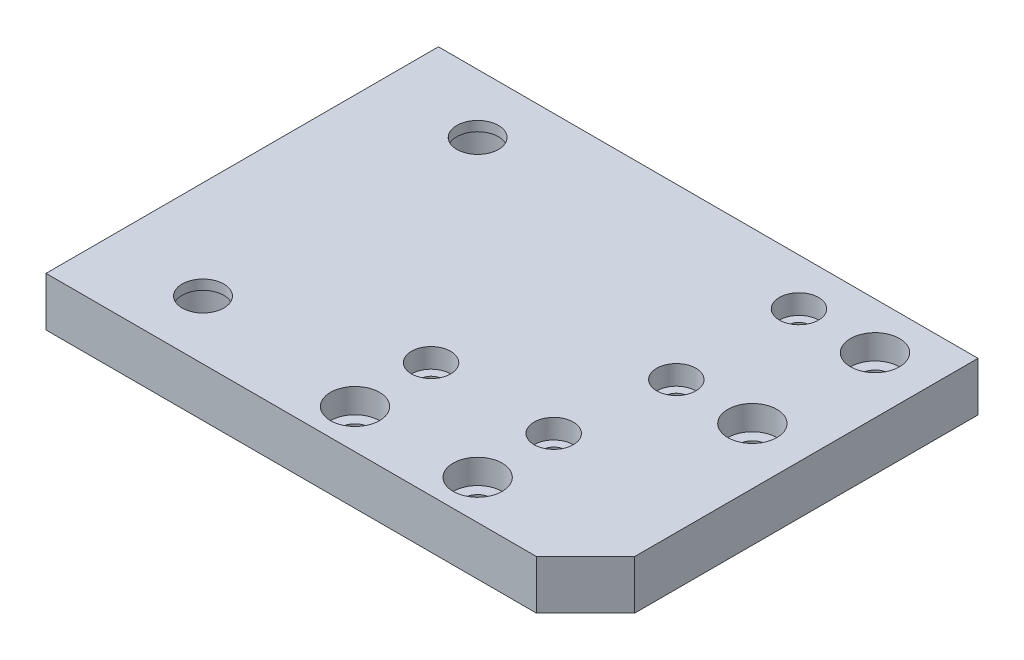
ISO-10303-21;
HEADER;
FILE_DESCRIPTION(('STEP AP214'),'2;1');
FILE_NAME('part.step','',(''),(''),'','','');
FILE_SCHEMA(('AUTOMOTIVE_DESIGN { 1 0 10303 214 1 1 1 1 }'));
ENDSEC;
DATA;
#1=APPLICATION_CONTEXT('core data for automotive mechanical design processes');
#2=APPLICATION_PROTOCOL_DEFINITION('international standard','automotive_design',2000,#1);
#3=PRODUCT_CONTEXT('',#1,'mechanical');
#4=PRODUCT('Part','Part','',(#3));
#5=PRODUCT_RELATED_PRODUCT_CATEGORY('part','',(#4));
#6=PRODUCT_DEFINITION_FORMATION('','',#4);
#7=PRODUCT_DEFINITION_CONTEXT('part definition',#1,'design');
#8=PRODUCT_DEFINITION('design','',#6,#7);
#9=PRODUCT_DEFINITION_SHAPE('','',#8);
#10=(LENGTH_UNIT() NAMED_UNIT(*) SI_UNIT(.MILLI.,.METRE.));
#11=(NAMED_UNIT(*) PLANE_ANGLE_UNIT() SI_UNIT($,.RADIAN.));
#12=(NAMED_UNIT(*) SI_UNIT($,.STERADIAN.) SOLID_ANGLE_UNIT());
#13=UNCERTAINTY_MEASURE_WITH_UNIT(LENGTH_MEASURE(1.E-05),#10,'distance_accuracy_value','');
#14=(GEOMETRIC_REPRESENTATION_CONTEXT(3) GLOBAL_UNCERTAINTY_ASSIGNED_CONTEXT((#13)) GLOBAL_UNIT_ASSIGNED_CONTEXT((#10,
#11,#12)) REPRESENTATION_CONTEXT('',''));
#15=CARTESIAN_POINT('',(0.,0.,0.));
#16=DIRECTION('',(0.,0.,1.));
#17=DIRECTION('',(1.,0.,0.));
#18=AXIS2_PLACEMENT_3D('',#15,#16,#17);
#19=CARTESIAN_POINT('',(-35.,0.,28.));
#20=DIRECTION('',(0.,1.,0.));
#21=DIRECTION('',(0.,0.,1.));
#22=AXIS2_PLACEMENT_3D('',#19,#20,#21);
#23=CYLINDRICAL_SURFACE('',#22,4.25);
#24=CARTESIAN_POINT('',(-35.,10.,28.));
#25=DIRECTION('',(0.,1.,0.));
#26=DIRECTION('',(0.,0.,1.));
#27=AXIS2_PLACEMENT_3D('',#24,#25,#26);
#28=CIRCLE('',#27,4.25);
#29=CARTESIAN_POINT('',(-35.,10.,32.25));
#30=VERTEX_POINT('',#29);
#31=EDGE_CURVE('E174',#30,#30,#28,.F.);
#32=ORIENTED_EDGE('',*,*,#31,.F.);
#33=EDGE_LOOP('',(#32));
#34=FACE_BOUND('',#33,.T.);
#35=CARTESIAN_POINT('',(-35.,8.,28.));
#36=DIRECTION('',(0.,1.,0.));
#37=DIRECTION('',(0.,0.,1.));
#38=AXIS2_PLACEMENT_3D('',#35,#36,#37);
#39=CIRCLE('',#38,4.25);
#40=CARTESIAN_POINT('',(-35.,8.,32.25));
#41=VERTEX_POINT('',#40);
#42=EDGE_CURVE('E200',#41,#41,#39,.T.);
#43=ORIENTED_EDGE('',*,*,#42,.F.);
#44=EDGE_LOOP('',(#43));
#45=FACE_BOUND('',#44,.T.);
#46=ADVANCED_FACE('F17',(#34,#45),#23,.F.);
#47=CARTESIAN_POINT('',(-35.,0.,-28.));
#48=DIRECTION('',(0.,1.,0.));
#49=DIRECTION('',(0.,0.,1.));
#50=AXIS2_PLACEMENT_3D('',#47,#48,#49);
#51=CYLINDRICAL_SURFACE('',#50,4.25);
#52=CARTESIAN_POINT('',(-35.,10.,-28.));
#53=DIRECTION('',(0.,1.,0.));
#54=DIRECTION('',(0.,0.,1.));
#55=AXIS2_PLACEMENT_3D('',#52,#53,#54);
#56=CIRCLE('',#55,4.25);
#57=CARTESIAN_POINT('',(-35.,10.,-23.75));
#58=VERTEX_POINT('',#57);
#59=EDGE_CURVE('E171',#58,#58,#56,.F.);
#60=ORIENTED_EDGE('',*,*,#59,.F.);
#61=EDGE_LOOP('',(#60));
#62=FACE_BOUND('',#61,.T.);
#63=CARTESIAN_POINT('',(-35.,8.,-28.));
#64=DIRECTION('',(0.,1.,0.));
#65=DIRECTION('',(0.,0.,1.));
#66=AXIS2_PLACEMENT_3D('',#63,#64,#65);
#67=CIRCLE('',#66,4.25);
#68=CARTESIAN_POINT('',(-35.,8.,-23.75));
#69=VERTEX_POINT('',#68);
#70=EDGE_CURVE('E20',#69,#69,#67,.T.);
#71=ORIENTED_EDGE('',*,*,#70,.F.);
#72=EDGE_LOOP('',(#71));
#73=FACE_BOUND('',#72,.T.);
#74=ADVANCED_FACE('F210',(#62,#73),#51,.F.);
#75=CARTESIAN_POINT('',(-1.44311645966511E-11,5.,32.0000000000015));
#76=DIRECTION('',(0.,1.,0.));
#77=DIRECTION('',(0.,0.,1.));
#78=AXIS2_PLACEMENT_3D('',#75,#76,#77);
#79=CYLINDRICAL_SURFACE('',#78,5.);
#80=CARTESIAN_POINT('',(-1.44311645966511E-11,10.,32.0000000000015));
#81=DIRECTION('',(0.,1.,0.));
#82=DIRECTION('',(0.,0.,1.));
#83=AXIS2_PLACEMENT_3D('',#80,#81,#82);
#84=CIRCLE('',#83,5.);
#85=CARTESIAN_POINT('',(-1.44311645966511E-11,10.,37.0000000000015));
#86=VERTEX_POINT('',#85);
#87=EDGE_CURVE('E168',#86,#86,#84,.F.);
#88=ORIENTED_EDGE('',*,*,#87,.F.);
#89=EDGE_LOOP('',(#88));
#90=FACE_BOUND('',#89,.T.);
#91=CARTESIAN_POINT('',(-1.44311645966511E-11,5.,32.0000000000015));
#92=DIRECTION('',(0.,1.,0.));
#93=DIRECTION('',(0.,0.,1.));
#94=AXIS2_PLACEMENT_3D('',#91,#92,#93);
#95=CIRCLE('',#94,5.);
#96=CARTESIAN_POINT('',(-1.44311645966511E-11,5.,37.0000000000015));
#97=VERTEX_POINT('',#96);
#98=EDGE_CURVE('E195',#97,#97,#95,.T.);
#99=ORIENTED_EDGE('',*,*,#98,.F.);
#100=EDGE_LOOP('',(#99));
#101=FACE_BOUND('',#100,.T.);
#102=ADVANCED_FACE('F212',(#90,#101),#79,.F.);
#103=CARTESIAN_POINT('',(24.9999999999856,5.,32.0000000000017));
#104=DIRECTION('',(0.,1.,0.));
#105=DIRECTION('',(0.,0.,1.));
#106=AXIS2_PLACEMENT_3D('',#103,#104,#105);
#107=CYLINDRICAL_SURFACE('',#106,5.);
#108=CARTESIAN_POINT('',(24.9999999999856,10.,32.0000000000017));
#109=DIRECTION('',(0.,1.,0.));
#110=DIRECTION('',(0.,0.,1.));
#111=AXIS2_PLACEMENT_3D('',#108,#109,#110);
#112=CIRCLE('',#111,5.);
#113=CARTESIAN_POINT('',(24.9999999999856,10.,37.0000000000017));
#114=VERTEX_POINT('',#113);
#115=EDGE_CURVE('E165',#114,#114,#112,.F.);
#116=ORIENTED_EDGE('',*,*,#115,.F.);
#117=EDGE_LOOP('',(#116));
#118=FACE_BOUND('',#117,.T.);
#119=CARTESIAN_POINT('',(24.9999999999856,5.,32.0000000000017));
#120=DIRECTION('',(0.,1.,0.));
#121=DIRECTION('',(0.,0.,1.));
#122=AXIS2_PLACEMENT_3D('',#119,#120,#121);
#123=CIRCLE('',#122,5.);
#124=CARTESIAN_POINT('',(24.9999999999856,5.,37.0000000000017));
#125=VERTEX_POINT('',#124);
#126=EDGE_CURVE('E192',#125,#125,#123,.T.);
#127=ORIENTED_EDGE('',*,*,#126,.F.);
#128=EDGE_LOOP('',(#127));
#129=FACE_BOUND('',#128,.T.);
#130=ADVANCED_FACE('F219',(#118,#129),#107,.F.);
#131=CARTESIAN_POINT('',(43.4999999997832,5.,-5.49999999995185));
#132=DIRECTION('',(0.,1.,0.));
#133=DIRECTION('',(0.,0.,1.));
#134=AXIS2_PLACEMENT_3D('',#131,#132,#133);
#135=CYLINDRICAL_SURFACE('',#134,5.);
#136=CARTESIAN_POINT('',(43.4999999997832,10.,-5.49999999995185));
#137=DIRECTION('',(0.,1.,0.));
#138=DIRECTION('',(0.,0.,1.));
#139=AXIS2_PLACEMENT_3D('',#136,#137,#138);
#140=CIRCLE('',#139,5.);
#141=CARTESIAN_POINT('',(43.4999999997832,10.,-0.499999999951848));
#142=VERTEX_POINT('',#141);
#143=EDGE_CURVE('E162',#142,#142,#140,.F.);
#144=ORIENTED_EDGE('',*,*,#143,.F.);
#145=EDGE_LOOP('',(#144));
#146=FACE_BOUND('',#145,.T.);
#147=CARTESIAN_POINT('',(43.4999999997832,5.,-5.49999999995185));
#148=DIRECTION('',(0.,1.,0.));
#149=DIRECTION('',(0.,0.,1.));
#150=AXIS2_PLACEMENT_3D('',#147,#148,#149);
#151=CIRCLE('',#150,5.);
#152=CARTESIAN_POINT('',(43.4999999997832,5.,-0.499999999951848));
#153=VERTEX_POINT('',#152);
#154=EDGE_CURVE('E183',#153,#153,#151,.T.);
#155=ORIENTED_EDGE('',*,*,#154,.F.);
#156=EDGE_LOOP('',(#155));
#157=FACE_BOUND('',#156,.T.);
#158=ADVANCED_FACE('F346',(#146,#157),#135,.F.);
#159=CARTESIAN_POINT('',(43.4999999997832,5.,-30.4999999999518));
#160=DIRECTION('',(0.,1.,0.));
#161=DIRECTION('',(0.,0.,1.));
#162=AXIS2_PLACEMENT_3D('',#159,#160,#161);
#163=CYLINDRICAL_SURFACE('',#162,5.);
#164=CARTESIAN_POINT('',(43.4999999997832,10.,-30.4999999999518));
#165=DIRECTION('',(0.,1.,0.));
#166=DIRECTION('',(0.,0.,1.));
#167=AXIS2_PLACEMENT_3D('',#164,#165,#166);
#168=CIRCLE('',#167,5.);
#169=CARTESIAN_POINT('',(43.4999999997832,10.,-25.4999999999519));
#170=VERTEX_POINT('',#169);
#171=EDGE_CURVE('E159',#170,#170,#168,.F.);
#172=ORIENTED_EDGE('',*,*,#171,.F.);
#173=EDGE_LOOP('',(#172));
#174=FACE_BOUND('',#173,.T.);
#175=CARTESIAN_POINT('',(43.4999999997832,5.,-30.4999999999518));
#176=DIRECTION('',(0.,1.,0.));
#177=DIRECTION('',(0.,0.,1.));
#178=AXIS2_PLACEMENT_3D('',#175,#176,#177);
#179=CIRCLE('',#178,5.);
#180=CARTESIAN_POINT('',(43.4999999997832,5.,-25.4999999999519));
#181=VERTEX_POINT('',#180);
#182=EDGE_CURVE('E186',#181,#181,#179,.T.);
#183=ORIENTED_EDGE('',*,*,#182,.F.);
#184=EDGE_LOOP('',(#183));
#185=FACE_BOUND('',#184,.T.);
#186=ADVANCED_FACE('F342',(#174,#185),#163,.F.);
#187=CARTESIAN_POINT('',(-2.82447676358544E-11,6.,16.5000000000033));
#188=DIRECTION('',(0.,1.,0.));
#189=DIRECTION('',(0.,0.,1.));
#190=AXIS2_PLACEMENT_3D('',#187,#188,#189);
#191=CYLINDRICAL_SURFACE('',#190,4.);
#192=CARTESIAN_POINT('',(-2.82447676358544E-11,10.,16.5000000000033));
#193=DIRECTION('',(0.,1.,0.));
#194=DIRECTION('',(0.,0.,1.));
#195=AXIS2_PLACEMENT_3D('',#192,#193,#194);
#196=CIRCLE('',#195,4.);
#197=CARTESIAN_POINT('',(-2.82447676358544E-11,10.,20.5000000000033));
#198=VERTEX_POINT('',#197);
#199=EDGE_CURVE('E156',#198,#198,#196,.F.);
#200=ORIENTED_EDGE('',*,*,#199,.F.);
#201=EDGE_LOOP('',(#200));
#202=FACE_BOUND('',#201,.T.);
#203=CARTESIAN_POINT('',(-2.82447676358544E-11,6.,16.5000000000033));
#204=DIRECTION('',(0.,1.,0.));
#205=DIRECTION('',(0.,0.,1.));
#206=AXIS2_PLACEMENT_3D('',#203,#204,#205);
#207=CIRCLE('',#206,4.);
#208=CARTESIAN_POINT('',(-2.82447676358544E-11,6.,20.5000000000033));
#209=VERTEX_POINT('',#208);
#210=EDGE_CURVE('E198',#209,#209,#207,.T.);
#211=ORIENTED_EDGE('',*,*,#210,.F.);
#212=EDGE_LOOP('',(#211));
#213=FACE_BOUND('',#212,.T.);
#214=ADVANCED_FACE('F338',(#202,#213),#191,.F.);
#215=CARTESIAN_POINT('',(24.9999999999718,6.,16.5000000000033));
#216=DIRECTION('',(0.,1.,0.));
#217=DIRECTION('',(0.,0.,1.));
#218=AXIS2_PLACEMENT_3D('',#215,#216,#217);
#219=CYLINDRICAL_SURFACE('',#218,4.);
#220=CARTESIAN_POINT('',(24.9999999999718,10.,16.5000000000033));
#221=DIRECTION('',(0.,1.,0.));
#222=DIRECTION('',(0.,0.,1.));
#223=AXIS2_PLACEMENT_3D('',#220,#221,#222);
#224=CIRCLE('',#223,4.);
#225=CARTESIAN_POINT('',(24.9999999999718,10.,20.5000000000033));
#226=VERTEX_POINT('',#225);
#227=EDGE_CURVE('E153',#226,#226,#224,.F.);
#228=ORIENTED_EDGE('',*,*,#227,.F.);
#229=EDGE_LOOP('',(#228));
#230=FACE_BOUND('',#229,.T.);
#231=CARTESIAN_POINT('',(24.9999999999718,6.,16.5000000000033));
#232=DIRECTION('',(0.,1.,0.));
#233=DIRECTION('',(0.,0.,1.));
#234=AXIS2_PLACEMENT_3D('',#231,#232,#233);
#235=CIRCLE('',#234,4.);
#236=CARTESIAN_POINT('',(24.9999999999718,6.,20.5000000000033));
#237=VERTEX_POINT('',#236);
#238=EDGE_CURVE('E189',#237,#237,#235,.T.);
#239=ORIENTED_EDGE('',*,*,#238,.F.);
#240=EDGE_LOOP('',(#239));
#241=FACE_BOUND('',#240,.T.);
#242=ADVANCED_FACE('F334',(#230,#241),#219,.F.);
#243=CARTESIAN_POINT('',(27.9999999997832,6.,-5.49999999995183));
#244=DIRECTION('',(0.,1.,0.));
#245=DIRECTION('',(0.,0.,1.));
#246=AXIS2_PLACEMENT_3D('',#243,#244,#245);
#247=CYLINDRICAL_SURFACE('',#246,4.00000000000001);
#248=CARTESIAN_POINT('',(27.9999999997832,10.,-5.49999999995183));
#249=DIRECTION('',(0.,1.,0.));
#250=DIRECTION('',(0.,0.,1.));
#251=AXIS2_PLACEMENT_3D('',#248,#249,#250);
#252=CIRCLE('',#251,4.00000000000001);
#253=CARTESIAN_POINT('',(27.9999999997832,10.,-1.49999999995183));
#254=VERTEX_POINT('',#253);
#255=EDGE_CURVE('E150',#254,#254,#252,.F.);
#256=ORIENTED_EDGE('',*,*,#255,.F.);
#257=EDGE_LOOP('',(#256));
#258=FACE_BOUND('',#257,.T.);
#259=CARTESIAN_POINT('',(27.9999999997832,6.,-5.49999999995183));
#260=DIRECTION('',(0.,1.,0.));
#261=DIRECTION('',(0.,0.,1.));
#262=AXIS2_PLACEMENT_3D('',#259,#260,#261);
#263=CIRCLE('',#262,4.00000000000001);
#264=CARTESIAN_POINT('',(27.9999999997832,6.,-1.49999999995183));
#265=VERTEX_POINT('',#264);
#266=EDGE_CURVE('E180',#265,#265,#263,.T.);
#267=ORIENTED_EDGE('',*,*,#266,.F.);
#268=EDGE_LOOP('',(#267));
#269=FACE_BOUND('',#268,.T.);
#270=ADVANCED_FACE('F330',(#258,#269),#247,.F.);
#271=CARTESIAN_POINT('',(27.9999999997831,6.,-30.4999999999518));
#272=DIRECTION('',(0.,1.,0.));
#273=DIRECTION('',(0.,0.,1.));
#274=AXIS2_PLACEMENT_3D('',#271,#272,#273);
#275=CYLINDRICAL_SURFACE('',#274,4.00000000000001);
#276=CARTESIAN_POINT('',(27.9999999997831,10.,-30.4999999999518));
#277=DIRECTION('',(0.,1.,0.));
#278=DIRECTION('',(0.,0.,1.));
#279=AXIS2_PLACEMENT_3D('',#276,#277,#278);
#280=CIRCLE('',#279,4.00000000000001);
#281=CARTESIAN_POINT('',(27.9999999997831,10.,-26.4999999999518));
#282=VERTEX_POINT('',#281);
#283=EDGE_CURVE('E147',#282,#282,#280,.F.);
#284=ORIENTED_EDGE('',*,*,#283,.F.);
#285=EDGE_LOOP('',(#284));
#286=FACE_BOUND('',#285,.T.);
#287=CARTESIAN_POINT('',(27.9999999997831,6.,-30.4999999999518));
#288=DIRECTION('',(0.,1.,0.));
#289=DIRECTION('',(0.,0.,1.));
#290=AXIS2_PLACEMENT_3D('',#287,#288,#289);
#291=CIRCLE('',#290,4.00000000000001);
#292=CARTESIAN_POINT('',(27.9999999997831,6.,-26.4999999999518));
#293=VERTEX_POINT('',#292);
#294=EDGE_CURVE('E177',#293,#293,#291,.T.);
#295=ORIENTED_EDGE('',*,*,#294,.F.);
#296=EDGE_LOOP('',(#295));
#297=FACE_BOUND('',#296,.T.);
#298=ADVANCED_FACE('F327',(#286,#297),#275,.F.);
#299=CARTESIAN_POINT('',(-35.,8.,-28.));
#300=DIRECTION('',(0.,-1.,0.));
#301=DIRECTION('',(0.,0.,-1.));
#302=AXIS2_PLACEMENT_3D('',#299,#300,#301);
#303=PLANE('',#302);
#304=ORIENTED_EDGE('',*,*,#70,.T.);
#305=EDGE_LOOP('',(#304));
#306=FACE_BOUND('',#305,.T.);
#307=CARTESIAN_POINT('',(-35.,8.,-28.));
#308=DIRECTION('',(0.,-1.,0.));
#309=DIRECTION('',(0.,0.,-1.));
#310=AXIS2_PLACEMENT_3D('',#307,#308,#309);
#311=CIRCLE('',#310,6.5);
#312=CARTESIAN_POINT('',(-35.,8.,-34.5));
#313=VERTEX_POINT('',#312);
#314=EDGE_CURVE('E144',#313,#313,#311,.T.);
#315=ORIENTED_EDGE('',*,*,#314,.T.);
#316=EDGE_LOOP('',(#315));
#317=FACE_BOUND('',#316,.T.);
#318=ADVANCED_FACE('F207',(#306,#317),#303,.T.);
#319=CARTESIAN_POINT('',(-35.,8.,28.));
#320=DIRECTION('',(0.,-1.,0.));
#321=DIRECTION('',(0.,0.,-1.));
#322=AXIS2_PLACEMENT_3D('',#319,#320,#321);
#323=PLANE('',#322);
#324=ORIENTED_EDGE('',*,*,#42,.T.);
#325=EDGE_LOOP('',(#324));
#326=FACE_BOUND('',#325,.T.);
#327=CARTESIAN_POINT('',(-35.,8.,28.));
#328=DIRECTION('',(0.,-1.,0.));
#329=DIRECTION('',(0.,0.,-1.));
#330=AXIS2_PLACEMENT_3D('',#327,#328,#329);
#331=CIRCLE('',#330,6.5);
#332=CARTESIAN_POINT('',(-35.,8.,21.5));
#333=VERTEX_POINT('',#332);
#334=EDGE_CURVE('E141',#333,#333,#331,.T.);
#335=ORIENTED_EDGE('',*,*,#334,.T.);
#336=EDGE_LOOP('',(#335));
#337=FACE_BOUND('',#336,.T.);
#338=ADVANCED_FACE('F321',(#326,#337),#323,.T.);
#339=CARTESIAN_POINT('',(-2.82447676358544E-11,6.,16.5000000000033));
#340=DIRECTION('',(0.,1.,0.));
#341=DIRECTION('',(0.,0.,1.));
#342=AXIS2_PLACEMENT_3D('',#339,#340,#341);
#343=PLANE('',#342);
#344=CARTESIAN_POINT('',(-2.82447676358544E-11,6.,16.5000000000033));
#345=DIRECTION('',(0.,1.,0.));
#346=DIRECTION('',(0.,0.,1.));
#347=AXIS2_PLACEMENT_3D('',#344,#345,#346);
#348=CIRCLE('',#347,2.25);
#349=CARTESIAN_POINT('',(-2.82447676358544E-11,6.,18.7500000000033));
#350=VERTEX_POINT('',#349);
#351=EDGE_CURVE('E138',#350,#350,#348,.F.);
#352=ORIENTED_EDGE('',*,*,#351,.T.);
#353=EDGE_LOOP('',(#352));
#354=FACE_BOUND('',#353,.T.);
#355=ORIENTED_EDGE('',*,*,#210,.T.);
#356=EDGE_LOOP('',(#355));
#357=FACE_BOUND('',#356,.T.);
#358=ADVANCED_FACE('F317',(#354,#357),#343,.T.);
#359=CARTESIAN_POINT('',(-1.44311645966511E-11,5.,32.0000000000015));
#360=DIRECTION('',(0.,1.,0.));
#361=DIRECTION('',(0.,0.,1.));
#362=AXIS2_PLACEMENT_3D('',#359,#360,#361);
#363=PLANE('',#362);
#364=CARTESIAN_POINT('',(-1.44311645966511E-11,5.,32.0000000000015));
#365=DIRECTION('',(0.,1.,0.));
#366=DIRECTION('',(0.,0.,1.));
#367=AXIS2_PLACEMENT_3D('',#364,#365,#366);
#368=CIRCLE('',#367,2.75);
#369=CARTESIAN_POINT('',(-1.44311645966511E-11,5.,34.7500000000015));
#370=VERTEX_POINT('',#369);
#371=EDGE_CURVE('E135',#370,#370,#368,.F.);
#372=ORIENTED_EDGE('',*,*,#371,.T.);
#373=EDGE_LOOP('',(#372));
#374=FACE_BOUND('',#373,.T.);
#375=ORIENTED_EDGE('',*,*,#98,.T.);
#376=EDGE_LOOP('',(#375));
#377=FACE_BOUND('',#376,.T.);
#378=ADVANCED_FACE('F313',(#374,#377),#363,.T.);
#379=CARTESIAN_POINT('',(24.9999999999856,5.,32.0000000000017));
#380=DIRECTION('',(0.,1.,0.));
#381=DIRECTION('',(0.,0.,1.));
#382=AXIS2_PLACEMENT_3D('',#379,#380,#381);
#383=PLANE('',#382);
#384=CARTESIAN_POINT('',(24.9999999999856,5.,32.0000000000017));
#385=DIRECTION('',(0.,1.,0.));
#386=DIRECTION('',(0.,0.,1.));
#387=AXIS2_PLACEMENT_3D('',#384,#385,#386);
#388=CIRCLE('',#387,2.75);
#389=CARTESIAN_POINT('',(24.9999999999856,5.,34.7500000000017));
#390=VERTEX_POINT('',#389);
#391=EDGE_CURVE('E132',#390,#390,#388,.F.);
#392=ORIENTED_EDGE('',*,*,#391,.T.);
#393=EDGE_LOOP('',(#392));
#394=FACE_BOUND('',#393,.T.);
#395=ORIENTED_EDGE('',*,*,#126,.T.);
#396=EDGE_LOOP('',(#395));
#397=FACE_BOUND('',#396,.T.);
#398=ADVANCED_FACE('F309',(#394,#397),#383,.T.);
#399=CARTESIAN_POINT('',(24.9999999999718,6.,16.5000000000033));
#400=DIRECTION('',(0.,1.,0.));
#401=DIRECTION('',(0.,0.,1.));
#402=AXIS2_PLACEMENT_3D('',#399,#400,#401);
#403=PLANE('',#402);
#404=CARTESIAN_POINT('',(24.9999999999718,6.,16.5000000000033));
#405=DIRECTION('',(0.,1.,0.));
#406=DIRECTION('',(0.,0.,1.));
#407=AXIS2_PLACEMENT_3D('',#404,#405,#406);
#408=CIRCLE('',#407,2.25);
#409=CARTESIAN_POINT('',(24.9999999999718,6.,18.7500000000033));
#410=VERTEX_POINT('',#409);
#411=EDGE_CURVE('E129',#410,#410,#408,.F.);
#412=ORIENTED_EDGE('',*,*,#411,.T.);
#413=EDGE_LOOP('',(#412));
#414=FACE_BOUND('',#413,.T.);
#415=ORIENTED_EDGE('',*,*,#238,.T.);
#416=EDGE_LOOP('',(#415));
#417=FACE_BOUND('',#416,.T.);
#418=ADVANCED_FACE('F305',(#414,#417),#403,.T.);
#419=CARTESIAN_POINT('',(43.4999999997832,5.,-30.4999999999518));
#420=DIRECTION('',(0.,1.,0.));
#421=DIRECTION('',(0.,0.,1.));
#422=AXIS2_PLACEMENT_3D('',#419,#420,#421);
#423=PLANE('',#422);
#424=CARTESIAN_POINT('',(43.4999999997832,5.,-30.4999999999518));
#425=DIRECTION('',(0.,1.,0.));
#426=DIRECTION('',(0.,0.,1.));
#427=AXIS2_PLACEMENT_3D('',#424,#425,#426);
#428=CIRCLE('',#427,2.75);
#429=CARTESIAN_POINT('',(43.4999999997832,5.,-27.7499999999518));
#430=VERTEX_POINT('',#429);
#431=EDGE_CURVE('E126',#430,#430,#428,.F.);
#432=ORIENTED_EDGE('',*,*,#431,.T.);
#433=EDGE_LOOP('',(#432));
#434=FACE_BOUND('',#433,.T.);
#435=ORIENTED_EDGE('',*,*,#182,.T.);
#436=EDGE_LOOP('',(#435));
#437=FACE_BOUND('',#436,.T.);
#438=ADVANCED_FACE('F301',(#434,#437),#423,.T.);
#439=CARTESIAN_POINT('',(43.4999999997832,5.,-5.49999999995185));
#440=DIRECTION('',(0.,1.,0.));
#441=DIRECTION('',(0.,0.,1.));
#442=AXIS2_PLACEMENT_3D('',#439,#440,#441);
#443=PLANE('',#442);
#444=CARTESIAN_POINT('',(43.4999999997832,5.,-5.49999999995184));
#445=DIRECTION('',(0.,1.,0.));
#446=DIRECTION('',(0.,0.,1.));
#447=AXIS2_PLACEMENT_3D('',#444,#445,#446);
#448=CIRCLE('',#447,2.75);
#449=CARTESIAN_POINT('',(43.4999999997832,5.,-2.74999999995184));
#450=VERTEX_POINT('',#449);
#451=EDGE_CURVE('E123',#450,#450,#448,.F.);
#452=ORIENTED_EDGE('',*,*,#451,.T.);
#453=EDGE_LOOP('',(#452));
#454=FACE_BOUND('',#453,.T.);
#455=ORIENTED_EDGE('',*,*,#154,.T.);
#456=EDGE_LOOP('',(#455));
#457=FACE_BOUND('',#456,.T.);
#458=ADVANCED_FACE('F297',(#454,#457),#443,.T.);
#459=CARTESIAN_POINT('',(27.9999999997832,6.,-5.49999999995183));
#460=DIRECTION('',(0.,1.,0.));
#461=DIRECTION('',(0.,0.,1.));
#462=AXIS2_PLACEMENT_3D('',#459,#460,#461);
#463=PLANE('',#462);
#464=CARTESIAN_POINT('',(27.9999999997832,6.,-5.49999999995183));
#465=DIRECTION('',(0.,1.,0.));
#466=DIRECTION('',(0.,0.,1.));
#467=AXIS2_PLACEMENT_3D('',#464,#465,#466);
#468=CIRCLE('',#467,2.25);
#469=CARTESIAN_POINT('',(27.9999999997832,6.,-3.24999999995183));
#470=VERTEX_POINT('',#469);
#471=EDGE_CURVE('E120',#470,#470,#468,.F.);
#472=ORIENTED_EDGE('',*,*,#471,.T.);
#473=EDGE_LOOP('',(#472));
#474=FACE_BOUND('',#473,.T.);
#475=ORIENTED_EDGE('',*,*,#266,.T.);
#476=EDGE_LOOP('',(#475));
#477=FACE_BOUND('',#476,.T.);
#478=ADVANCED_FACE('F293',(#474,#477),#463,.T.);
#479=CARTESIAN_POINT('',(27.9999999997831,6.,-30.4999999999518));
#480=DIRECTION('',(0.,1.,0.));
#481=DIRECTION('',(0.,0.,1.));
#482=AXIS2_PLACEMENT_3D('',#479,#480,#481);
#483=PLANE('',#482);
#484=CARTESIAN_POINT('',(27.9999999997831,6.,-30.4999999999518));
#485=DIRECTION('',(0.,1.,0.));
#486=DIRECTION('',(0.,0.,1.));
#487=AXIS2_PLACEMENT_3D('',#484,#485,#486);
#488=CIRCLE('',#487,2.25);
#489=CARTESIAN_POINT('',(27.9999999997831,6.,-28.2499999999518));
#490=VERTEX_POINT('',#489);
#491=EDGE_CURVE('E73',#490,#490,#488,.F.);
#492=ORIENTED_EDGE('',*,*,#491,.T.);
#493=EDGE_LOOP('',(#492));
#494=FACE_BOUND('',#493,.T.);
#495=ORIENTED_EDGE('',*,*,#294,.T.);
#496=EDGE_LOOP('',(#495));
#497=FACE_BOUND('',#496,.T.);
#498=ADVANCED_FACE('F290',(#494,#497),#483,.T.);
#499=CARTESIAN_POINT('',(0.,10.,0.));
#500=DIRECTION('',(0.,1.,0.));
#501=DIRECTION('',(0.,0.,1.));
#502=AXIS2_PLACEMENT_3D('',#499,#500,#501);
#503=PLANE('',#502);
#504=DIRECTION('',(1.,0.,0.));
#505=VECTOR('',#504,1.);
#506=CARTESIAN_POINT('',(-55.,10.,-40.));
#507=LINE('',#506,#505);
#508=CARTESIAN_POINT('',(55.,10.,-40.));
#509=VERTEX_POINT('',#508);
#510=CARTESIAN_POINT('',(-55.,10.,-40.));
#511=VERTEX_POINT('',#510);
#512=EDGE_CURVE('E64',#509,#511,#507,.F.);
#513=ORIENTED_EDGE('',*,*,#512,.T.);
#514=DIRECTION('',(0.,0.,-1.));
#515=VECTOR('',#514,1.);
#516=CARTESIAN_POINT('',(-55.,10.,-40.));
#517=LINE('',#516,#515);
#518=CARTESIAN_POINT('',(-55.,10.,40.));
#519=VERTEX_POINT('',#518);
#520=EDGE_CURVE('E61',#511,#519,#517,.F.);
#521=ORIENTED_EDGE('',*,*,#520,.T.);
#522=DIRECTION('',(-1.,0.,0.));
#523=VECTOR('',#522,1.);
#524=CARTESIAN_POINT('',(-55.,10.,40.));
#525=LINE('',#524,#523);
#526=CARTESIAN_POINT('',(45.,10.,40.));
#527=VERTEX_POINT('',#526);
#528=EDGE_CURVE('E664',#519,#527,#525,.F.);
#529=ORIENTED_EDGE('',*,*,#528,.T.);
#530=DIRECTION('',(-0.707106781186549,0.,0.707106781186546));
#531=VECTOR('',#530,1.);
#532=CARTESIAN_POINT('',(55.,10.,30.));
#533=LINE('',#532,#531);
#534=CARTESIAN_POINT('',(55.,10.,30.));
#535=VERTEX_POINT('',#534);
#536=EDGE_CURVE('E669',#527,#535,#533,.F.);
#537=ORIENTED_EDGE('',*,*,#536,.T.);
#538=DIRECTION('',(0.,0.,1.));
#539=VECTOR('',#538,1.);
#540=CARTESIAN_POINT('',(55.,10.,-40.));
#541=LINE('',#540,#539);
#542=EDGE_CURVE('E67',#535,#509,#541,.F.);
#543=ORIENTED_EDGE('',*,*,#542,.T.);
#544=EDGE_LOOP('',(#513,#521,#529,#537,#543));
#545=FACE_BOUND('',#544,.T.);
#546=ORIENTED_EDGE('',*,*,#283,.T.);
#547=EDGE_LOOP('',(#546));
#548=FACE_BOUND('',#547,.T.);
#549=ORIENTED_EDGE('',*,*,#255,.T.);
#550=EDGE_LOOP('',(#549));
#551=FACE_BOUND('',#550,.T.);
#552=ORIENTED_EDGE('',*,*,#227,.T.);
#553=EDGE_LOOP('',(#552));
#554=FACE_BOUND('',#553,.T.);
#555=ORIENTED_EDGE('',*,*,#199,.T.);
#556=EDGE_LOOP('',(#555));
#557=FACE_BOUND('',#556,.T.);
#558=ORIENTED_EDGE('',*,*,#171,.T.);
#559=EDGE_LOOP('',(#558));
#560=FACE_BOUND('',#559,.T.);
#561=ORIENTED_EDGE('',*,*,#143,.T.);
#562=EDGE_LOOP('',(#561));
#563=FACE_BOUND('',#562,.T.);
#564=ORIENTED_EDGE('',*,*,#115,.T.);
#565=EDGE_LOOP('',(#564));
#566=FACE_BOUND('',#565,.T.);
#567=ORIENTED_EDGE('',*,*,#87,.T.);
#568=EDGE_LOOP('',(#567));
#569=FACE_BOUND('',#568,.T.);
#570=ORIENTED_EDGE('',*,*,#59,.T.);
#571=EDGE_LOOP('',(#570));
#572=FACE_BOUND('',#571,.T.);
#573=ORIENTED_EDGE('',*,*,#31,.T.);
#574=EDGE_LOOP('',(#573));
#575=FACE_BOUND('',#574,.T.);
#576=ADVANCED_FACE('F65',(#545,#548,#551,#554,#557,#560,#563,#566,#569,#572,#575),#503,.T.);
#577=CARTESIAN_POINT('',(-35.,8.,-28.));
#578=DIRECTION('',(0.,-1.,0.));
#579=DIRECTION('',(0.,0.,-1.));
#580=AXIS2_PLACEMENT_3D('',#577,#578,#579);
#581=CYLINDRICAL_SURFACE('',#580,6.5);
#582=ORIENTED_EDGE('',*,*,#314,.F.);
#583=EDGE_LOOP('',(#582));
#584=FACE_BOUND('',#583,.T.);
#585=CARTESIAN_POINT('',(-35.,0.,-28.));
#586=DIRECTION('',(0.,-1.,0.));
#587=DIRECTION('',(0.,0.,-1.));
#588=AXIS2_PLACEMENT_3D('',#585,#586,#587);
#589=CIRCLE('',#588,6.5);
#590=CARTESIAN_POINT('',(-35.,0.,-34.5));
#591=VERTEX_POINT('',#590);
#592=EDGE_CURVE('E115',#591,#591,#589,.T.);
#593=ORIENTED_EDGE('',*,*,#592,.T.);
#594=EDGE_LOOP('',(#593));
#595=FACE_BOUND('',#594,.T.);
#596=ADVANCED_FACE('F283',(#584,#595),#581,.F.);
#597=CARTESIAN_POINT('',(-35.,8.,28.));
#598=DIRECTION('',(0.,-1.,0.));
#599=DIRECTION('',(0.,0.,-1.));
#600=AXIS2_PLACEMENT_3D('',#597,#598,#599);
#601=CYLINDRICAL_SURFACE('',#600,6.5);
#602=ORIENTED_EDGE('',*,*,#334,.F.);
#603=EDGE_LOOP('',(#602));
#604=FACE_BOUND('',#603,.T.);
#605=CARTESIAN_POINT('',(-35.,0.,28.));
#606=DIRECTION('',(0.,-1.,0.));
#607=DIRECTION('',(0.,0.,-1.));
#608=AXIS2_PLACEMENT_3D('',#605,#606,#607);
#609=CIRCLE('',#608,6.5);
#610=CARTESIAN_POINT('',(-35.,0.,21.5));
#611=VERTEX_POINT('',#610);
#612=EDGE_CURVE('E112',#611,#611,#609,.T.);
#613=ORIENTED_EDGE('',*,*,#612,.T.);
#614=EDGE_LOOP('',(#613));
#615=FACE_BOUND('',#614,.T.);
#616=ADVANCED_FACE('F279',(#604,#615),#601,.F.);
#617=CARTESIAN_POINT('',(-2.82447676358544E-11,0.,16.5000000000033));
#618=DIRECTION('',(0.,1.,0.));
#619=DIRECTION('',(0.,0.,1.));
#620=AXIS2_PLACEMENT_3D('',#617,#618,#619);
#621=CYLINDRICAL_SURFACE('',#620,2.25);
#622=CARTESIAN_POINT('',(-2.82447676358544E-11,0.,16.5000000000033));
#623=DIRECTION('',(0.,1.,0.));
#624=DIRECTION('',(0.,0.,1.));
#625=AXIS2_PLACEMENT_3D('',#622,#623,#624);
#626=CIRCLE('',#625,2.25);
#627=CARTESIAN_POINT('',(-2.82447676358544E-11,0.,18.7500000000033));
#628=VERTEX_POINT('',#627);
#629=EDGE_CURVE('E109',#628,#628,#626,.F.);
#630=ORIENTED_EDGE('',*,*,#629,.T.);
#631=EDGE_LOOP('',(#630));
#632=FACE_BOUND('',#631,.T.);
#633=ORIENTED_EDGE('',*,*,#351,.F.);
#634=EDGE_LOOP('',(#633));
#635=FACE_BOUND('',#634,.T.);
#636=ADVANCED_FACE('F275',(#632,#635),#621,.F.);
#637=CARTESIAN_POINT('',(-1.44311645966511E-11,0.,32.0000000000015));
#638=DIRECTION('',(0.,1.,0.));
#639=DIRECTION('',(0.,0.,1.));
#640=AXIS2_PLACEMENT_3D('',#637,#638,#639);
#641=CYLINDRICAL_SURFACE('',#640,2.75);
#642=CARTESIAN_POINT('',(-1.44311645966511E-11,0.,32.0000000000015));
#643=DIRECTION('',(0.,1.,0.));
#644=DIRECTION('',(0.,0.,1.));
#645=AXIS2_PLACEMENT_3D('',#642,#643,#644);
#646=CIRCLE('',#645,2.75);
#647=CARTESIAN_POINT('',(-1.44311645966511E-11,0.,34.7500000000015));
#648=VERTEX_POINT('',#647);
#649=EDGE_CURVE('E106',#648,#648,#646,.F.);
#650=ORIENTED_EDGE('',*,*,#649,.T.);
#651=EDGE_LOOP('',(#650));
#652=FACE_BOUND('',#651,.T.);
#653=ORIENTED_EDGE('',*,*,#371,.F.);
#654=EDGE_LOOP('',(#653));
#655=FACE_BOUND('',#654,.T.);
#656=ADVANCED_FACE('F271',(#652,#655),#641,.F.);
#657=CARTESIAN_POINT('',(24.9999999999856,0.,32.0000000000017));
#658=DIRECTION('',(0.,1.,0.));
#659=DIRECTION('',(0.,0.,1.));
#660=AXIS2_PLACEMENT_3D('',#657,#658,#659);
#661=CYLINDRICAL_SURFACE('',#660,2.75);
#662=CARTESIAN_POINT('',(24.9999999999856,0.,32.0000000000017));
#663=DIRECTION('',(0.,1.,0.));
#664=DIRECTION('',(0.,0.,1.));
#665=AXIS2_PLACEMENT_3D('',#662,#663,#664);
#666=CIRCLE('',#665,2.75);
#667=CARTESIAN_POINT('',(24.9999999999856,0.,34.7500000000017));
#668=VERTEX_POINT('',#667);
#669=EDGE_CURVE('E103',#668,#668,#666,.F.);
#670=ORIENTED_EDGE('',*,*,#669,.T.);
#671=EDGE_LOOP('',(#670));
#672=FACE_BOUND('',#671,.T.);
#673=ORIENTED_EDGE('',*,*,#391,.F.);
#674=EDGE_LOOP('',(#673));
#675=FACE_BOUND('',#674,.T.);
#676=ADVANCED_FACE('F267',(#672,#675),#661,.F.);
#677=CARTESIAN_POINT('',(24.9999999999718,0.,16.5000000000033));
#678=DIRECTION('',(0.,1.,0.));
#679=DIRECTION('',(0.,0.,1.));
#680=AXIS2_PLACEMENT_3D('',#677,#678,#679);
#681=CYLINDRICAL_SURFACE('',#680,2.25);
#682=CARTESIAN_POINT('',(24.9999999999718,0.,16.5000000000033));
#683=DIRECTION('',(0.,1.,0.));
#684=DIRECTION('',(0.,0.,1.));
#685=AXIS2_PLACEMENT_3D('',#682,#683,#684);
#686=CIRCLE('',#685,2.25);
#687=CARTESIAN_POINT('',(24.9999999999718,0.,18.7500000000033));
#688=VERTEX_POINT('',#687);
#689=EDGE_CURVE('E100',#688,#688,#686,.F.);
#690=ORIENTED_EDGE('',*,*,#689,.T.);
#691=EDGE_LOOP('',(#690));
#692=FACE_BOUND('',#691,.T.);
#693=ORIENTED_EDGE('',*,*,#411,.F.);
#694=EDGE_LOOP('',(#693));
#695=FACE_BOUND('',#694,.T.);
#696=ADVANCED_FACE('F263',(#692,#695),#681,.F.);
#697=CARTESIAN_POINT('',(43.4999999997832,0.,-30.4999999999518));
#698=DIRECTION('',(0.,1.,0.));
#699=DIRECTION('',(0.,0.,1.));
#700=AXIS2_PLACEMENT_3D('',#697,#698,#699);
#701=CYLINDRICAL_SURFACE('',#700,2.75);
#702=CARTESIAN_POINT('',(43.4999999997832,0.,-30.4999999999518));
#703=DIRECTION('',(0.,1.,0.));
#704=DIRECTION('',(0.,0.,1.));
#705=AXIS2_PLACEMENT_3D('',#702,#703,#704);
#706=CIRCLE('',#705,2.75);
#707=CARTESIAN_POINT('',(43.4999999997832,0.,-27.7499999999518));
#708=VERTEX_POINT('',#707);
#709=EDGE_CURVE('E97',#708,#708,#706,.F.);
#710=ORIENTED_EDGE('',*,*,#709,.T.);
#711=EDGE_LOOP('',(#710));
#712=FACE_BOUND('',#711,.T.);
#713=ORIENTED_EDGE('',*,*,#431,.F.);
#714=EDGE_LOOP('',(#713));
#715=FACE_BOUND('',#714,.T.);
#716=ADVANCED_FACE('F259',(#712,#715),#701,.F.);
#717=CARTESIAN_POINT('',(43.4999999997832,0.,-5.49999999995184));
#718=DIRECTION('',(0.,1.,0.));
#719=DIRECTION('',(0.,0.,1.));
#720=AXIS2_PLACEMENT_3D('',#717,#718,#719);
#721=CYLINDRICAL_SURFACE('',#720,2.75);
#722=CARTESIAN_POINT('',(43.4999999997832,0.,-5.49999999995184));
#723=DIRECTION('',(0.,1.,0.));
#724=DIRECTION('',(0.,0.,1.));
#725=AXIS2_PLACEMENT_3D('',#722,#723,#724);
#726=CIRCLE('',#725,2.75);
#727=CARTESIAN_POINT('',(43.4999999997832,0.,-2.74999999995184));
#728=VERTEX_POINT('',#727);
#729=EDGE_CURVE('E94',#728,#728,#726,.F.);
#730=ORIENTED_EDGE('',*,*,#729,.T.);
#731=EDGE_LOOP('',(#730));
#732=FACE_BOUND('',#731,.T.);
#733=ORIENTED_EDGE('',*,*,#451,.F.);
#734=EDGE_LOOP('',(#733));
#735=FACE_BOUND('',#734,.T.);
#736=ADVANCED_FACE('F255',(#732,#735),#721,.F.);
#737=CARTESIAN_POINT('',(27.9999999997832,0.,-5.49999999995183));
#738=DIRECTION('',(0.,1.,0.));
#739=DIRECTION('',(0.,0.,1.));
#740=AXIS2_PLACEMENT_3D('',#737,#738,#739);
#741=CYLINDRICAL_SURFACE('',#740,2.25);
#742=CARTESIAN_POINT('',(27.9999999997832,0.,-5.49999999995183));
#743=DIRECTION('',(0.,1.,0.));
#744=DIRECTION('',(0.,0.,1.));
#745=AXIS2_PLACEMENT_3D('',#742,#743,#744);
#746=CIRCLE('',#745,2.25);
#747=CARTESIAN_POINT('',(27.9999999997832,0.,-3.24999999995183));
#748=VERTEX_POINT('',#747);
#749=EDGE_CURVE('E91',#748,#748,#746,.F.);
#750=ORIENTED_EDGE('',*,*,#749,.T.);
#751=EDGE_LOOP('',(#750));
#752=FACE_BOUND('',#751,.T.);
#753=ORIENTED_EDGE('',*,*,#471,.F.);
#754=EDGE_LOOP('',(#753));
#755=FACE_BOUND('',#754,.T.);
#756=ADVANCED_FACE('F251',(#752,#755),#741,.F.);
#757=CARTESIAN_POINT('',(27.9999999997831,0.,-30.4999999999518));
#758=DIRECTION('',(0.,1.,0.));
#759=DIRECTION('',(0.,0.,1.));
#760=AXIS2_PLACEMENT_3D('',#757,#758,#759);
#761=CYLINDRICAL_SURFACE('',#760,2.25);
#762=CARTESIAN_POINT('',(27.9999999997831,0.,-30.4999999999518));
#763=DIRECTION('',(0.,1.,0.));
#764=DIRECTION('',(0.,0.,1.));
#765=AXIS2_PLACEMENT_3D('',#762,#763,#764);
#766=CIRCLE('',#765,2.25);
#767=CARTESIAN_POINT('',(27.9999999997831,0.,-28.2499999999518));
#768=VERTEX_POINT('',#767);
#769=EDGE_CURVE('E88',#768,#768,#766,.F.);
#770=ORIENTED_EDGE('',*,*,#769,.T.);
#771=EDGE_LOOP('',(#770));
#772=FACE_BOUND('',#771,.T.);
#773=ORIENTED_EDGE('',*,*,#491,.F.);
#774=EDGE_LOOP('',(#773));
#775=FACE_BOUND('',#774,.T.);
#776=ADVANCED_FACE('F248',(#772,#775),#761,.F.);
#777=CARTESIAN_POINT('',(-55.,10.,-40.));
#778=DIRECTION('',(0.,0.,1.));
#779=DIRECTION('',(1.,0.,0.));
#780=AXIS2_PLACEMENT_3D('',#777,#778,#779);
#781=PLANE('',#780);
#782=DIRECTION('',(0.,1.,0.));
#783=VECTOR('',#782,1.);
#784=CARTESIAN_POINT('',(-55.,10.,-40.));
#785=LINE('',#784,#783);
#786=CARTESIAN_POINT('',(-55.,0.,-40.));
#787=VERTEX_POINT('',#786);
#788=EDGE_CURVE('E72',#787,#511,#785,.T.);
#789=ORIENTED_EDGE('',*,*,#788,.T.);
#790=ORIENTED_EDGE('',*,*,#512,.F.);
#791=DIRECTION('',(0.,1.,0.));
#792=VECTOR('',#791,1.);
#793=CARTESIAN_POINT('',(55.,10.,-40.));
#794=LINE('',#793,#792);
#795=CARTESIAN_POINT('',(55.,0.,-40.));
#796=VERTEX_POINT('',#795);
#797=EDGE_CURVE('E671',#509,#796,#794,.F.);
#798=ORIENTED_EDGE('',*,*,#797,.T.);
#799=DIRECTION('',(1.,0.,0.));
#800=VECTOR('',#799,1.);
#801=CARTESIAN_POINT('',(0.,0.,-40.));
#802=LINE('',#801,#800);
#803=EDGE_CURVE('E84',#796,#787,#802,.F.);
#804=ORIENTED_EDGE('',*,*,#803,.T.);
#805=EDGE_LOOP('',(#789,#790,#798,#804));
#806=FACE_BOUND('',#805,.T.);
#807=ADVANCED_FACE('F83',(#806),#781,.F.);
#808=CARTESIAN_POINT('',(-55.,10.,-40.));
#809=DIRECTION('',(1.,0.,0.));
#810=DIRECTION('',(0.,0.,-1.));
#811=AXIS2_PLACEMENT_3D('',#808,#809,#810);
#812=PLANE('',#811);
#813=DIRECTION('',(0.,1.,0.));
#814=VECTOR('',#813,1.);
#815=CARTESIAN_POINT('',(-55.,10.,40.));
#816=LINE('',#815,#814);
#817=CARTESIAN_POINT('',(-55.,0.,40.));
#818=VERTEX_POINT('',#817);
#819=EDGE_CURVE('E80',#818,#519,#816,.T.);
#820=ORIENTED_EDGE('',*,*,#819,.T.);
#821=ORIENTED_EDGE('',*,*,#520,.F.);
#822=ORIENTED_EDGE('',*,*,#788,.F.);
#823=DIRECTION('',(0.,0.,1.));
#824=VECTOR('',#823,1.);
#825=CARTESIAN_POINT('',(-55.,0.,0.));
#826=LINE('',#825,#824);
#827=EDGE_CURVE('E679',#787,#818,#826,.T.);
#828=ORIENTED_EDGE('',*,*,#827,.T.);
#829=EDGE_LOOP('',(#820,#821,#822,#828));
#830=FACE_BOUND('',#829,.T.);
#831=ADVANCED_FACE('F77',(#830),#812,.F.);
#832=CARTESIAN_POINT('',(-55.,10.,40.));
#833=DIRECTION('',(0.,0.,-1.));
#834=DIRECTION('',(-1.,0.,0.));
#835=AXIS2_PLACEMENT_3D('',#832,#833,#834);
#836=PLANE('',#835);
#837=DIRECTION('',(0.,1.,0.));
#838=VECTOR('',#837,1.);
#839=CARTESIAN_POINT('',(45.,10.,40.));
#840=LINE('',#839,#838);
#841=CARTESIAN_POINT('',(45.,0.,40.));
#842=VERTEX_POINT('',#841);
#843=EDGE_CURVE('E663',#842,#527,#840,.T.);
#844=ORIENTED_EDGE('',*,*,#843,.T.);
#845=ORIENTED_EDGE('',*,*,#528,.F.);
#846=ORIENTED_EDGE('',*,*,#819,.F.);
#847=DIRECTION('',(1.,0.,0.));
#848=VECTOR('',#847,1.);
#849=CARTESIAN_POINT('',(0.,0.,40.));
#850=LINE('',#849,#848);
#851=EDGE_CURVE('E666',#818,#842,#850,.T.);
#852=ORIENTED_EDGE('',*,*,#851,.T.);
#853=EDGE_LOOP('',(#844,#845,#846,#852));
#854=FACE_BOUND('',#853,.T.);
#855=ADVANCED_FACE('F239',(#854),#836,.F.);
#856=CARTESIAN_POINT('',(55.,10.,30.));
#857=DIRECTION('',(-0.707106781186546,0.,-0.707106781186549));
#858=DIRECTION('',(-0.707106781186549,0.,0.707106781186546));
#859=AXIS2_PLACEMENT_3D('',#856,#857,#858);
#860=PLANE('',#859);
#861=ORIENTED_EDGE('',*,*,#843,.F.);
#862=DIRECTION('',(0.70710678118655,0.,-0.707106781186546));
#863=VECTOR('',#862,1.);
#864=CARTESIAN_POINT('',(45.,0.,40.));
#865=LINE('',#864,#863);
#866=CARTESIAN_POINT('',(55.,0.,30.));
#867=VERTEX_POINT('',#866);
#868=EDGE_CURVE('E26',#842,#867,#865,.T.);
#869=ORIENTED_EDGE('',*,*,#868,.T.);
#870=DIRECTION('',(0.,1.,0.));
#871=VECTOR('',#870,1.);
#872=CARTESIAN_POINT('',(55.,10.,30.));
#873=LINE('',#872,#871);
#874=EDGE_CURVE('E34',#867,#535,#873,.T.);
#875=ORIENTED_EDGE('',*,*,#874,.T.);
#876=ORIENTED_EDGE('',*,*,#536,.F.);
#877=EDGE_LOOP('',(#861,#869,#875,#876));
#878=FACE_BOUND('',#877,.T.);
#879=ADVANCED_FACE('F232',(#878),#860,.F.);
#880=CARTESIAN_POINT('',(55.,10.,-40.));
#881=DIRECTION('',(-1.,0.,0.));
#882=DIRECTION('',(0.,0.,1.));
#883=AXIS2_PLACEMENT_3D('',#880,#881,#882);
#884=PLANE('',#883);
#885=ORIENTED_EDGE('',*,*,#874,.F.);
#886=DIRECTION('',(0.,0.,1.));
#887=VECTOR('',#886,1.);
#888=CARTESIAN_POINT('',(55.,0.,0.));
#889=LINE('',#888,#887);
#890=EDGE_CURVE('E11',#867,#796,#889,.F.);
#891=ORIENTED_EDGE('',*,*,#890,.T.);
#892=ORIENTED_EDGE('',*,*,#797,.F.);
#893=ORIENTED_EDGE('',*,*,#542,.F.);
#894=EDGE_LOOP('',(#885,#891,#892,#893));
#895=FACE_BOUND('',#894,.T.);
#896=ADVANCED_FACE('F226',(#895),#884,.F.);
#897=CARTESIAN_POINT('',(0.,0.,0.));
#898=DIRECTION('',(0.,1.,0.));
#899=DIRECTION('',(0.,0.,1.));
#900=AXIS2_PLACEMENT_3D('',#897,#898,#899);
#901=PLANE('',#900);
#902=ORIENTED_EDGE('',*,*,#868,.F.);
#903=ORIENTED_EDGE('',*,*,#851,.F.);
#904=ORIENTED_EDGE('',*,*,#827,.F.);
#905=ORIENTED_EDGE('',*,*,#803,.F.);
#906=ORIENTED_EDGE('',*,*,#890,.F.);
#907=EDGE_LOOP('',(#902,#903,#904,#905,#906));
#908=FACE_BOUND('',#907,.T.);
#909=ORIENTED_EDGE('',*,*,#769,.F.);
#910=EDGE_LOOP('',(#909));
#911=FACE_BOUND('',#910,.T.);
#912=ORIENTED_EDGE('',*,*,#749,.F.);
#913=EDGE_LOOP('',(#912));
#914=FACE_BOUND('',#913,.T.);
#915=ORIENTED_EDGE('',*,*,#729,.F.);
#916=EDGE_LOOP('',(#915));
#917=FACE_BOUND('',#916,.T.);
#918=ORIENTED_EDGE('',*,*,#709,.F.);
#919=EDGE_LOOP('',(#918));
#920=FACE_BOUND('',#919,.T.);
#921=ORIENTED_EDGE('',*,*,#689,.F.);
#922=EDGE_LOOP('',(#921));
#923=FACE_BOUND('',#922,.T.);
#924=ORIENTED_EDGE('',*,*,#669,.F.);
#925=EDGE_LOOP('',(#924));
#926=FACE_BOUND('',#925,.T.);
#927=ORIENTED_EDGE('',*,*,#649,.F.);
#928=EDGE_LOOP('',(#927));
#929=FACE_BOUND('',#928,.T.);
#930=ORIENTED_EDGE('',*,*,#629,.F.);
#931=EDGE_LOOP('',(#930));
#932=FACE_BOUND('',#931,.T.);
#933=ORIENTED_EDGE('',*,*,#612,.F.);
#934=EDGE_LOOP('',(#933));
#935=FACE_BOUND('',#934,.T.);
#936=ORIENTED_EDGE('',*,*,#592,.F.);
#937=EDGE_LOOP('',(#936));
#938=FACE_BOUND('',#937,.T.);
#939=ADVANCED_FACE('F224',(#908,#911,#914,#917,#920,#923,#926,#929,#932,#935,#938),#901,.F.);
#940=CLOSED_SHELL('',(#46,#74,#102,#130,#158,#186,#214,#242,#270,#298,#318,#338,#358,#378,#398,
#418,#438,#458,#478,#498,#576,#596,#616,#636,#656,#676,#696,#716,#736,#756,#776,#807,#831,#855,
#879,#896,#939));
#941=MANIFOLD_SOLID_BREP('B1',#940);
#942=ADVANCED_BREP_SHAPE_REPRESENTATION('',(#18,#941),#14);
#943=SHAPE_DEFINITION_REPRESENTATION(#9,#942);
ENDSEC;
END-ISO-10303-21;
